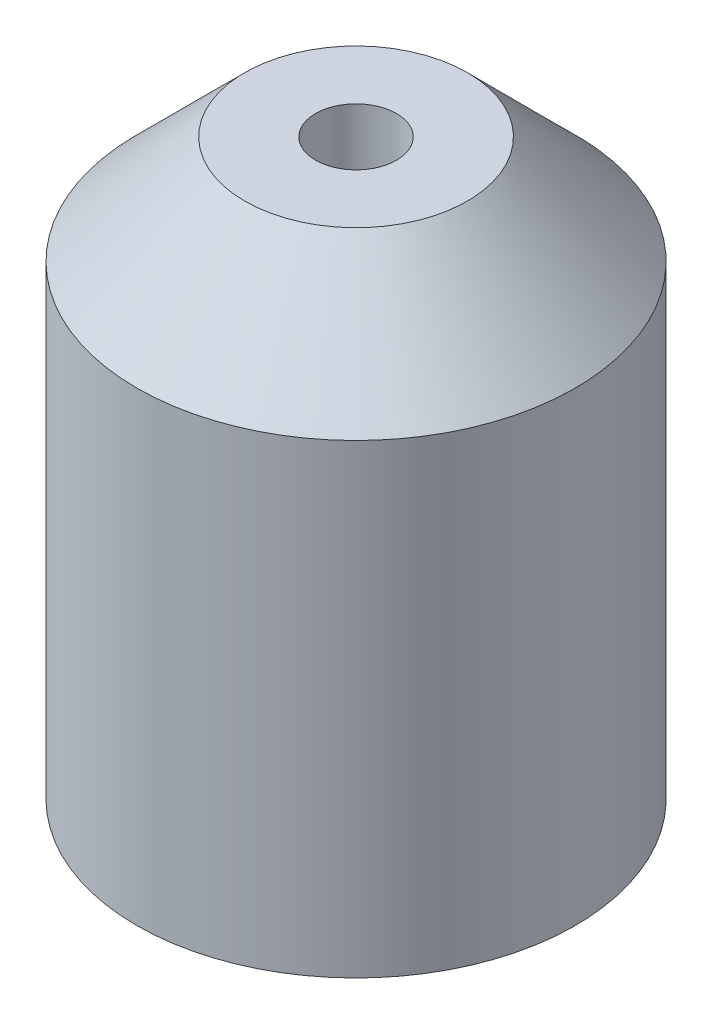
from build123d import *

# Parameters (mm, degrees)
SKETCH1_R          = 20.6375
SKETCH1_R_2        = 3.81
EXTRUDE1_DEPTH     = 53.975
CHAMFER2_SIZE      = 1.27
CHAMFER2_SIZE2     = 0.733234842
SKETCH20_R         = 3.81
CUT_EXTRUDE1_DEPTH = 87.092278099
CHAMFER3_SIZE      = 10.16


with BuildPart() as part:
    # Sketch1 → Extrude1 (new body)
    with BuildSketch(Plane(origin=(0, 0, 0), x_dir=(1, 0, 0), z_dir=(0, 1, 0))):
        with Locations(Location((0, -43.18, 0), (0, 0, 270))):
            Circle(SKETCH1_R)
        with Locations(Location((0, -43.18, 0), (0, 0, 270))):
            Circle(SKETCH1_R_2, mode=Mode.SUBTRACT)
    extrude(amount=EXTRUDE1_DEPTH)

    # Sketch19 → Cut-Revolve6 (revolve, cut)
    with BuildSketch(Plane(origin=(0, 0, 0), x_dir=(0, 0, -1), z_dir=(1, 0, 0))):
        Polygon((-43.18, 0), (-29.68625, 0), (-29.68625, 39.37), (-43.18, 47.477862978), align=None)
    revolve(axis=Axis((0, 0, 43.18), (0, -1, 0)), mode=Mode.SUBTRACT)

    # Chamfer2
    chamfer2_edges = [part.edges().sort_by_distance(p)[0] for p in [
        (0, 0, 56.67375),
    ]]
    chamfer2_side = [part.faces().sort_by_distance(p)[0] for p in [
        (0, 19.685, 56.67375),
    ]]
    chamfer(chamfer2_edges, length=CHAMFER2_SIZE, length2=CHAMFER2_SIZE2, reference=chamfer2_side[0])

    # Sketch20 → Cut-Extrude1 (cut, through all)
    with BuildSketch(Plane(origin=(0, 0, 0), x_dir=(0, 0, -1), z_dir=(1, 0, 0))):
        with Locations((-43.18, 32.221738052)):
            Circle(SKETCH20_R)
    extrude(amount=-CUT_EXTRUDE1_DEPTH, mode=Mode.SUBTRACT)

    # Chamfer3
    chamfer3_edges = [part.edges().sort_by_distance(p)[0] for p in [
        (0, 53.975, 22.5425),
    ]]
    chamfer(chamfer3_edges, length=CHAMFER3_SIZE)


solid = part.part
